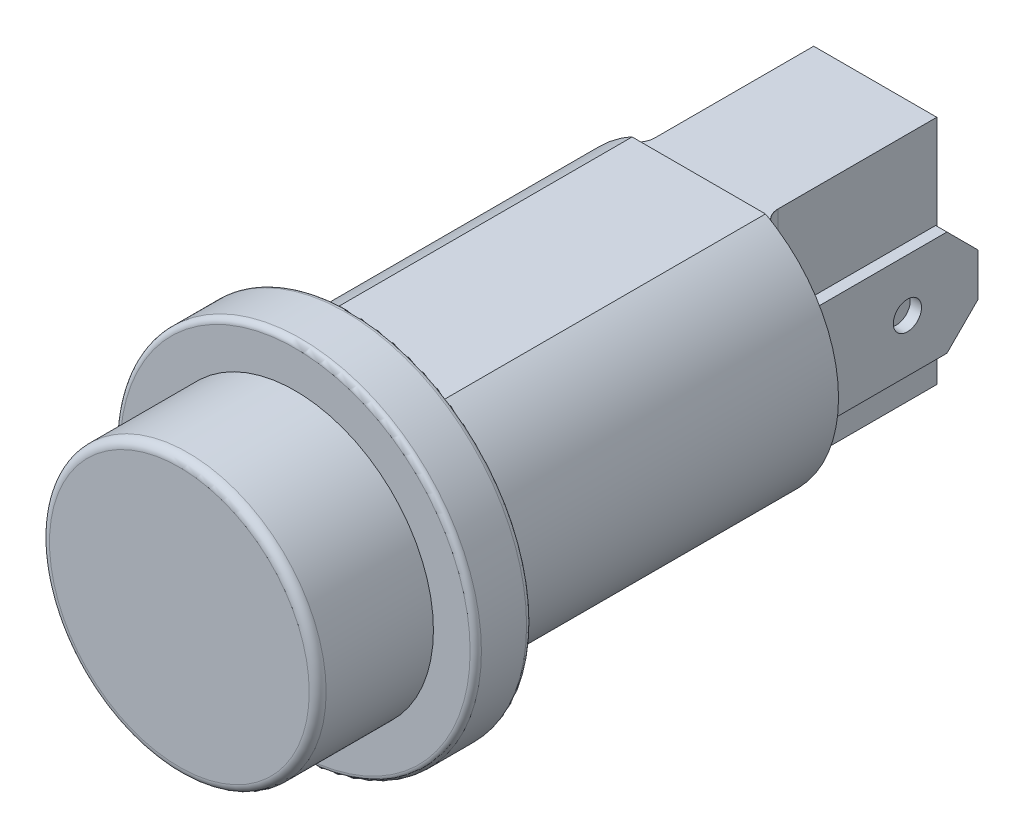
ISO-10303-21;
HEADER;
FILE_DESCRIPTION(('STEP AP214'),'2;1');
FILE_NAME('part.step','',(''),(''),'','','');
FILE_SCHEMA(('AUTOMOTIVE_DESIGN { 1 0 10303 214 1 1 1 1 }'));
ENDSEC;
DATA;
#1=APPLICATION_CONTEXT('core data for automotive mechanical design processes');
#2=APPLICATION_PROTOCOL_DEFINITION('international standard','automotive_design',2000,#1);
#3=PRODUCT_CONTEXT('',#1,'mechanical');
#4=PRODUCT('Part','Part','',(#3));
#5=PRODUCT_RELATED_PRODUCT_CATEGORY('part','',(#4));
#6=PRODUCT_DEFINITION_FORMATION('','',#4);
#7=PRODUCT_DEFINITION_CONTEXT('part definition',#1,'design');
#8=PRODUCT_DEFINITION('design','',#6,#7);
#9=PRODUCT_DEFINITION_SHAPE('','',#8);
#10=(LENGTH_UNIT() NAMED_UNIT(*) SI_UNIT(.MILLI.,.METRE.));
#11=(NAMED_UNIT(*) PLANE_ANGLE_UNIT() SI_UNIT($,.RADIAN.));
#12=(NAMED_UNIT(*) SI_UNIT($,.STERADIAN.) SOLID_ANGLE_UNIT());
#13=UNCERTAINTY_MEASURE_WITH_UNIT(LENGTH_MEASURE(1.E-05),#10,'distance_accuracy_value','');
#14=(GEOMETRIC_REPRESENTATION_CONTEXT(3) GLOBAL_UNCERTAINTY_ASSIGNED_CONTEXT((#13)) GLOBAL_UNIT_ASSIGNED_CONTEXT((#10,
#11,#12)) REPRESENTATION_CONTEXT('',''));
#15=CARTESIAN_POINT('',(0.,0.,0.));
#16=DIRECTION('',(0.,0.,1.));
#17=DIRECTION('',(1.,0.,0.));
#18=AXIS2_PLACEMENT_3D('',#15,#16,#17);
#19=CARTESIAN_POINT('',(-4.6228,2.3622,-19.6215));
#20=DIRECTION('',(1.,0.,0.));
#21=DIRECTION('',(0.,0.,-1.));
#22=AXIS2_PLACEMENT_3D('',#19,#20,#21);
#23=PLANE('',#22);
#24=DIRECTION('',(0.,1.,0.));
#25=VECTOR('',#24,1.);
#26=CARTESIAN_POINT('',(-4.6228,2.3622,-19.6215));
#27=LINE('',#26,#25);
#28=CARTESIAN_POINT('',(-4.6228,-0.965199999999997,-19.6215));
#29=VERTEX_POINT('',#28);
#30=CARTESIAN_POINT('',(-4.6228,0.965199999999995,-19.6215));
#31=VERTEX_POINT('',#30);
#32=EDGE_CURVE('E228',#29,#31,#27,.T.);
#33=ORIENTED_EDGE('',*,*,#32,.F.);
#34=DIRECTION('',(0.,0.707106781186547,-0.707106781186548));
#35=VECTOR('',#34,1.);
#36=CARTESIAN_POINT('',(-4.6228,-0.965199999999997,-19.6215));
#37=LINE('',#36,#35);
#38=CARTESIAN_POINT('',(-4.6228,-2.3622,-18.2245));
#39=VERTEX_POINT('',#38);
#40=EDGE_CURVE('E207',#29,#39,#37,.F.);
#41=ORIENTED_EDGE('',*,*,#40,.T.);
#42=DIRECTION('',(0.,0.,1.));
#43=VECTOR('',#42,1.);
#44=CARTESIAN_POINT('',(-4.6228,-2.3622,-19.6215));
#45=LINE('',#44,#43);
#46=CARTESIAN_POINT('',(-4.6228,-2.3622,-11.684));
#47=VERTEX_POINT('',#46);
#48=EDGE_CURVE('E201',#39,#47,#45,.T.);
#49=ORIENTED_EDGE('',*,*,#48,.T.);
#50=DIRECTION('',(0.,1.,0.));
#51=VECTOR('',#50,1.);
#52=CARTESIAN_POINT('',(-4.6228,2.3622,-11.684));
#53=LINE('',#52,#51);
#54=CARTESIAN_POINT('',(-4.6228,2.3622,-11.684));
#55=VERTEX_POINT('',#54);
#56=EDGE_CURVE('E206',#47,#55,#53,.T.);
#57=ORIENTED_EDGE('',*,*,#56,.T.);
#58=DIRECTION('',(0.,0.,1.));
#59=VECTOR('',#58,1.);
#60=CARTESIAN_POINT('',(-4.6228,2.3622,-19.6215));
#61=LINE('',#60,#59);
#62=CARTESIAN_POINT('',(-4.6228,2.3622,-18.2245));
#63=VERTEX_POINT('',#62);
#64=EDGE_CURVE('E239',#63,#55,#61,.T.);
#65=ORIENTED_EDGE('',*,*,#64,.F.);
#66=DIRECTION('',(0.,0.707106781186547,0.707106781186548));
#67=VECTOR('',#66,1.);
#68=CARTESIAN_POINT('',(-4.6228,0.965199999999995,-19.6215));
#69=LINE('',#68,#67);
#70=EDGE_CURVE('E1024',#63,#31,#69,.F.);
#71=ORIENTED_EDGE('',*,*,#70,.T.);
#72=EDGE_LOOP('',(#33,#41,#49,#57,#65,#71));
#73=FACE_BOUND('',#72,.T.);
#74=CARTESIAN_POINT('',(-4.6228,0.,-16.4465));
#75=DIRECTION('',(1.,0.,0.));
#76=DIRECTION('',(0.,0.,-1.));
#77=AXIS2_PLACEMENT_3D('',#74,#75,#76);
#78=CIRCLE('',#77,0.634999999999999);
#79=CARTESIAN_POINT('',(-4.6228,0.,-17.0815));
#80=VERTEX_POINT('',#79);
#81=EDGE_CURVE('E1039',#80,#80,#78,.T.);
#82=ORIENTED_EDGE('',*,*,#81,.T.);
#83=EDGE_LOOP('',(#82));
#84=FACE_BOUND('',#83,.T.);
#85=ADVANCED_FACE('F38',(#73,#84),#23,.F.);
#86=CARTESIAN_POINT('',(-4.1148,2.3622,-19.6215));
#87=DIRECTION('',(-1.,0.,0.));
#88=DIRECTION('',(0.,0.,1.));
#89=AXIS2_PLACEMENT_3D('',#86,#87,#88);
#90=PLANE('',#89);
#91=DIRECTION('',(0.,0.,1.));
#92=VECTOR('',#91,1.);
#93=CARTESIAN_POINT('',(-4.1148,-2.3622,-19.6215));
#94=LINE('',#93,#92);
#95=CARTESIAN_POINT('',(-4.1148,-2.3622,-18.2245));
#96=VERTEX_POINT('',#95);
#97=CARTESIAN_POINT('',(-4.1148,-2.3622,-11.684));
#98=VERTEX_POINT('',#97);
#99=EDGE_CURVE('E211',#96,#98,#94,.T.);
#100=ORIENTED_EDGE('',*,*,#99,.F.);
#101=DIRECTION('',(0.,-0.707106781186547,0.707106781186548));
#102=VECTOR('',#101,1.);
#103=CARTESIAN_POINT('',(-4.1148,-0.965199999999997,-19.6215));
#104=LINE('',#103,#102);
#105=CARTESIAN_POINT('',(-4.1148,-0.965199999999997,-19.6215));
#106=VERTEX_POINT('',#105);
#107=EDGE_CURVE('E1017',#96,#106,#104,.F.);
#108=ORIENTED_EDGE('',*,*,#107,.T.);
#109=DIRECTION('',(0.,-1.,0.));
#110=VECTOR('',#109,1.);
#111=CARTESIAN_POINT('',(-4.1148,2.3622,-19.6215));
#112=LINE('',#111,#110);
#113=CARTESIAN_POINT('',(-4.1148,0.965199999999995,-19.6215));
#114=VERTEX_POINT('',#113);
#115=EDGE_CURVE('E212',#114,#106,#112,.T.);
#116=ORIENTED_EDGE('',*,*,#115,.F.);
#117=DIRECTION('',(0.,-0.707106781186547,-0.707106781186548));
#118=VECTOR('',#117,1.);
#119=CARTESIAN_POINT('',(-4.1148,0.965199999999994,-19.6215));
#120=LINE('',#119,#118);
#121=CARTESIAN_POINT('',(-4.1148,2.3622,-18.2245));
#122=VERTEX_POINT('',#121);
#123=EDGE_CURVE('E1019',#114,#122,#120,.F.);
#124=ORIENTED_EDGE('',*,*,#123,.T.);
#125=DIRECTION('',(0.,0.,1.));
#126=VECTOR('',#125,1.);
#127=CARTESIAN_POINT('',(-4.1148,2.3622,-19.6215));
#128=LINE('',#127,#126);
#129=CARTESIAN_POINT('',(-4.1148,2.3622,-11.684));
#130=VERTEX_POINT('',#129);
#131=EDGE_CURVE('E237',#122,#130,#128,.T.);
#132=ORIENTED_EDGE('',*,*,#131,.T.);
#133=DIRECTION('',(0.,-1.,0.));
#134=VECTOR('',#133,1.);
#135=CARTESIAN_POINT('',(-4.1148,2.3622,-11.684));
#136=LINE('',#135,#134);
#137=EDGE_CURVE('E229',#130,#98,#136,.T.);
#138=ORIENTED_EDGE('',*,*,#137,.T.);
#139=EDGE_LOOP('',(#100,#108,#116,#124,#132,#138));
#140=FACE_BOUND('',#139,.T.);
#141=CARTESIAN_POINT('',(-4.1148,0.,-16.4465));
#142=DIRECTION('',(-1.,0.,0.));
#143=DIRECTION('',(0.,0.,1.));
#144=AXIS2_PLACEMENT_3D('',#141,#142,#143);
#145=CIRCLE('',#144,0.634999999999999);
#146=CARTESIAN_POINT('',(-4.1148,0.,-15.8115));
#147=VERTEX_POINT('',#146);
#148=EDGE_CURVE('E42',#147,#147,#145,.F.);
#149=ORIENTED_EDGE('',*,*,#148,.F.);
#150=EDGE_LOOP('',(#149));
#151=FACE_BOUND('',#150,.T.);
#152=ADVANCED_FACE('F453',(#140,#151),#90,.F.);
#153=CARTESIAN_POINT('',(0.,6.2865,-11.684));
#154=DIRECTION('',(0.,0.,1.));
#155=DIRECTION('',(1.,0.,0.));
#156=AXIS2_PLACEMENT_3D('',#153,#154,#155);
#157=PLANE('',#156);
#158=DIRECTION('',(1.,0.,0.));
#159=VECTOR('',#158,1.);
#160=CARTESIAN_POINT('',(2.7686,5.207,-11.684));
#161=LINE('',#160,#159);
#162=CARTESIAN_POINT('',(-3.52239027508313,5.20699999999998,-11.684));
#163=VERTEX_POINT('',#162);
#164=CARTESIAN_POINT('',(3.5223902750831,5.207,-11.684));
#165=VERTEX_POINT('',#164);
#166=EDGE_CURVE('E272',#163,#165,#161,.T.);
#167=ORIENTED_EDGE('',*,*,#166,.F.);
#168=CARTESIAN_POINT('',(0.,0.,-11.684));
#169=DIRECTION('',(0.,0.,1.));
#170=DIRECTION('',(1.,0.,0.));
#171=AXIS2_PLACEMENT_3D('',#168,#169,#170);
#172=CIRCLE('',#171,6.2865);
#173=CARTESIAN_POINT('',(-2.9999969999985,5.5245,-11.684));
#174=VERTEX_POINT('',#173);
#175=EDGE_CURVE('E314',#174,#163,#172,.T.);
#176=ORIENTED_EDGE('',*,*,#175,.F.);
#177=DIRECTION('',(1.,0.,0.));
#178=VECTOR('',#177,1.);
#179=CARTESIAN_POINT('',(0.,5.5245,-11.684));
#180=LINE('',#179,#178);
#181=CARTESIAN_POINT('',(2.9999969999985,5.5245,-11.684));
#182=VERTEX_POINT('',#181);
#183=EDGE_CURVE('E330',#174,#182,#180,.T.);
#184=ORIENTED_EDGE('',*,*,#183,.T.);
#185=EDGE_CURVE('E313',#165,#182,#172,.T.);
#186=ORIENTED_EDGE('',*,*,#185,.F.);
#187=EDGE_LOOP('',(#167,#176,#184,#186));
#188=FACE_BOUND('',#187,.T.);
#189=ADVANCED_FACE('F458',(#188),#157,.F.);
#190=ORIENTED_EDGE('',*,*,#56,.F.);
#191=DIRECTION('',(-1.,0.,0.));
#192=VECTOR('',#191,1.);
#193=CARTESIAN_POINT('',(-4.6228,-2.3622,-11.684));
#194=LINE('',#193,#192);
#195=EDGE_CURVE('E220',#98,#47,#194,.T.);
#196=ORIENTED_EDGE('',*,*,#195,.F.);
#197=ORIENTED_EDGE('',*,*,#137,.F.);
#198=DIRECTION('',(1.,0.,0.));
#199=VECTOR('',#198,1.);
#200=CARTESIAN_POINT('',(-4.6228,2.3622,-11.684));
#201=LINE('',#200,#199);
#202=EDGE_CURVE('E223',#55,#130,#201,.T.);
#203=ORIENTED_EDGE('',*,*,#202,.F.);
#204=EDGE_LOOP('',(#190,#196,#197,#203));
#205=FACE_BOUND('',#204,.T.);
#206=CARTESIAN_POINT('',(-3.56235,5.1797436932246,-11.684));
#207=VERTEX_POINT('',#206);
#208=CARTESIAN_POINT('',(-3.56235,-5.1797436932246,-11.684));
#209=VERTEX_POINT('',#208);
#210=EDGE_CURVE('E961',#207,#209,#172,.T.);
#211=ORIENTED_EDGE('',*,*,#210,.F.);
#212=DIRECTION('',(0.,1.,0.));
#213=VECTOR('',#212,1.);
#214=CARTESIAN_POINT('',(-3.56235,-5.207,-11.684));
#215=LINE('',#214,#213);
#216=EDGE_CURVE('E942',#207,#209,#215,.F.);
#217=ORIENTED_EDGE('',*,*,#216,.T.);
#218=EDGE_LOOP('',(#211,#217));
#219=FACE_BOUND('',#218,.T.);
#220=ADVANCED_FACE('F217',(#205,#219),#157,.F.);
#221=CARTESIAN_POINT('',(-3.5223902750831,-5.207,-11.684));
#222=VERTEX_POINT('',#221);
#223=CARTESIAN_POINT('',(3.52239027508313,-5.20699999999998,-11.684));
#224=VERTEX_POINT('',#223);
#225=EDGE_CURVE('E968',#222,#224,#172,.T.);
#226=ORIENTED_EDGE('',*,*,#225,.F.);
#227=DIRECTION('',(-1.,0.,0.));
#228=VECTOR('',#227,1.);
#229=CARTESIAN_POINT('',(2.7686,-5.207,-11.684));
#230=LINE('',#229,#228);
#231=EDGE_CURVE('E267',#224,#222,#230,.T.);
#232=ORIENTED_EDGE('',*,*,#231,.F.);
#233=EDGE_LOOP('',(#226,#232));
#234=FACE_BOUND('',#233,.T.);
#235=ADVANCED_FACE('F558',(#234),#157,.F.);
#236=DIRECTION('',(0.,-1.,0.));
#237=VECTOR('',#236,1.);
#238=CARTESIAN_POINT('',(4.6228,2.3622,-11.684));
#239=LINE('',#238,#237);
#240=CARTESIAN_POINT('',(4.6228,2.3622,-11.684));
#241=VERTEX_POINT('',#240);
#242=CARTESIAN_POINT('',(4.6228,-2.3622,-11.684));
#243=VERTEX_POINT('',#242);
#244=EDGE_CURVE('E241',#241,#243,#239,.T.);
#245=ORIENTED_EDGE('',*,*,#244,.F.);
#246=DIRECTION('',(1.,0.,0.));
#247=VECTOR('',#246,1.);
#248=CARTESIAN_POINT('',(4.6228,2.3622,-11.684));
#249=LINE('',#248,#247);
#250=CARTESIAN_POINT('',(4.1148,2.3622,-11.684));
#251=VERTEX_POINT('',#250);
#252=EDGE_CURVE('E246',#251,#241,#249,.T.);
#253=ORIENTED_EDGE('',*,*,#252,.F.);
#254=DIRECTION('',(0.,1.,0.));
#255=VECTOR('',#254,1.);
#256=CARTESIAN_POINT('',(4.1148,2.3622,-11.684));
#257=LINE('',#256,#255);
#258=CARTESIAN_POINT('',(4.1148,-2.3622,-11.684));
#259=VERTEX_POINT('',#258);
#260=EDGE_CURVE('E255',#259,#251,#257,.T.);
#261=ORIENTED_EDGE('',*,*,#260,.F.);
#262=DIRECTION('',(-1.,0.,0.));
#263=VECTOR('',#262,1.);
#264=CARTESIAN_POINT('',(4.6228,-2.3622,-11.684));
#265=LINE('',#264,#263);
#266=EDGE_CURVE('E252',#243,#259,#265,.T.);
#267=ORIENTED_EDGE('',*,*,#266,.F.);
#268=EDGE_LOOP('',(#245,#253,#261,#267));
#269=FACE_BOUND('',#268,.T.);
#270=CARTESIAN_POINT('',(3.56235,-5.1797436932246,-11.684));
#271=VERTEX_POINT('',#270);
#272=CARTESIAN_POINT('',(3.56235,5.1797436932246,-11.684));
#273=VERTEX_POINT('',#272);
#274=EDGE_CURVE('E973',#271,#273,#172,.T.);
#275=ORIENTED_EDGE('',*,*,#274,.F.);
#276=DIRECTION('',(0.,-1.,0.));
#277=VECTOR('',#276,1.);
#278=CARTESIAN_POINT('',(3.56235,5.207,-11.684));
#279=LINE('',#278,#277);
#280=EDGE_CURVE('E944',#271,#273,#279,.F.);
#281=ORIENTED_EDGE('',*,*,#280,.T.);
#282=EDGE_LOOP('',(#275,#281));
#283=FACE_BOUND('',#282,.T.);
#284=ADVANCED_FACE('F522',(#269,#283),#157,.F.);
#285=CARTESIAN_POINT('',(0.,0.,6.223));
#286=DIRECTION('',(0.,0.,1.));
#287=DIRECTION('',(1.,0.,0.));
#288=AXIS2_PLACEMENT_3D('',#285,#286,#287);
#289=TOROIDAL_SURFACE('',#288,7.874,0.254);
#290=CARTESIAN_POINT('',(0.,0.,6.477));
#291=DIRECTION('',(0.,0.,1.));
#292=DIRECTION('',(1.,0.,0.));
#293=AXIS2_PLACEMENT_3D('',#290,#291,#292);
#294=CIRCLE('',#293,7.874);
#295=CARTESIAN_POINT('',(7.874,0.,6.477));
#296=VERTEX_POINT('',#295);
#297=EDGE_CURVE('E301',#296,#296,#294,.T.);
#298=ORIENTED_EDGE('',*,*,#297,.F.);
#299=EDGE_LOOP('',(#298));
#300=FACE_BOUND('',#299,.T.);
#301=CARTESIAN_POINT('',(0.,0.,6.223));
#302=DIRECTION('',(0.,0.,1.));
#303=DIRECTION('',(1.,0.,0.));
#304=AXIS2_PLACEMENT_3D('',#301,#302,#303);
#305=CIRCLE('',#304,8.128);
#306=CARTESIAN_POINT('',(8.128,0.,6.223));
#307=VERTEX_POINT('',#306);
#308=EDGE_CURVE('E327',#307,#307,#305,.T.);
#309=ORIENTED_EDGE('',*,*,#308,.T.);
#310=EDGE_LOOP('',(#309));
#311=FACE_BOUND('',#310,.T.);
#312=ADVANCED_FACE('F350',(#300,#311),#289,.T.);
#313=CARTESIAN_POINT('',(0.,0.,11.684));
#314=DIRECTION('',(0.,0.,1.));
#315=DIRECTION('',(1.,0.,0.));
#316=AXIS2_PLACEMENT_3D('',#313,#314,#315);
#317=CYLINDRICAL_SURFACE('',#316,8.128);
#318=ORIENTED_EDGE('',*,*,#308,.F.);
#319=EDGE_LOOP('',(#318));
#320=FACE_BOUND('',#319,.T.);
#321=CARTESIAN_POINT('',(0.,0.,4.191));
#322=DIRECTION('',(0.,0.,1.));
#323=DIRECTION('',(1.,0.,0.));
#324=AXIS2_PLACEMENT_3D('',#321,#322,#323);
#325=CIRCLE('',#324,8.128);
#326=CARTESIAN_POINT('',(8.128,0.,4.191));
#327=VERTEX_POINT('',#326);
#328=EDGE_CURVE('E324',#327,#327,#325,.T.);
#329=ORIENTED_EDGE('',*,*,#328,.T.);
#330=EDGE_LOOP('',(#329));
#331=FACE_BOUND('',#330,.T.);
#332=ADVANCED_FACE('F540',(#320,#331),#317,.T.);
#333=CARTESIAN_POINT('',(0.,0.,4.191));
#334=DIRECTION('',(0.,0.,1.));
#335=DIRECTION('',(1.,0.,0.));
#336=AXIS2_PLACEMENT_3D('',#333,#334,#335);
#337=TOROIDAL_SURFACE('',#336,7.874,0.253999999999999);
#338=ORIENTED_EDGE('',*,*,#328,.F.);
#339=EDGE_LOOP('',(#338));
#340=FACE_BOUND('',#339,.T.);
#341=CARTESIAN_POINT('',(0.,0.,3.937));
#342=DIRECTION('',(0.,0.,1.));
#343=DIRECTION('',(1.,0.,0.));
#344=AXIS2_PLACEMENT_3D('',#341,#342,#343);
#345=CIRCLE('',#344,7.874);
#346=CARTESIAN_POINT('',(7.874,0.,3.937));
#347=VERTEX_POINT('',#346);
#348=EDGE_CURVE('E321',#347,#347,#345,.T.);
#349=ORIENTED_EDGE('',*,*,#348,.T.);
#350=EDGE_LOOP('',(#349));
#351=FACE_BOUND('',#350,.T.);
#352=ADVANCED_FACE('F537',(#340,#351),#337,.T.);
#353=CARTESIAN_POINT('',(0.,7.874,3.937));
#354=DIRECTION('',(0.,0.,1.));
#355=DIRECTION('',(1.,0.,0.));
#356=AXIS2_PLACEMENT_3D('',#353,#354,#355);
#357=PLANE('',#356);
#358=DIRECTION('',(-1.,0.,0.));
#359=VECTOR('',#358,1.);
#360=CARTESIAN_POINT('',(4.06350387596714,5.5245,3.937));
#361=LINE('',#360,#359);
#362=CARTESIAN_POINT('',(2.9999969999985,5.5245,3.937));
#363=VERTEX_POINT('',#362);
#364=CARTESIAN_POINT('',(-2.9999969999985,5.5245,3.937));
#365=VERTEX_POINT('',#364);
#366=EDGE_CURVE('E292',#363,#365,#361,.T.);
#367=ORIENTED_EDGE('',*,*,#366,.T.);
#368=CARTESIAN_POINT('',(0.,0.,3.937));
#369=DIRECTION('',(0.,0.,1.));
#370=DIRECTION('',(1.,0.,0.));
#371=AXIS2_PLACEMENT_3D('',#368,#369,#370);
#372=CIRCLE('',#371,6.2865);
#373=EDGE_CURVE('E317',#365,#363,#372,.T.);
#374=ORIENTED_EDGE('',*,*,#373,.T.);
#375=EDGE_LOOP('',(#367,#374));
#376=FACE_BOUND('',#375,.T.);
#377=ORIENTED_EDGE('',*,*,#348,.F.);
#378=EDGE_LOOP('',(#377));
#379=FACE_BOUND('',#378,.T.);
#380=ADVANCED_FACE('F530',(#376,#379),#357,.F.);
#381=CARTESIAN_POINT('',(0.,0.,11.684));
#382=DIRECTION('',(0.,0.,1.));
#383=DIRECTION('',(1.,0.,0.));
#384=AXIS2_PLACEMENT_3D('',#381,#382,#383);
#385=CYLINDRICAL_SURFACE('',#384,6.2865);
#386=ORIENTED_EDGE('',*,*,#175,.T.);
#387=EDGE_CURVE('E318',#163,#207,#172,.T.);
#388=ORIENTED_EDGE('',*,*,#387,.T.);
#389=ORIENTED_EDGE('',*,*,#210,.T.);
#390=EDGE_CURVE('E966',#209,#222,#172,.T.);
#391=ORIENTED_EDGE('',*,*,#390,.T.);
#392=ORIENTED_EDGE('',*,*,#225,.T.);
#393=EDGE_CURVE('E969',#224,#271,#172,.T.);
#394=ORIENTED_EDGE('',*,*,#393,.T.);
#395=ORIENTED_EDGE('',*,*,#274,.T.);
#396=EDGE_CURVE('E976',#273,#165,#172,.T.);
#397=ORIENTED_EDGE('',*,*,#396,.T.);
#398=ORIENTED_EDGE('',*,*,#185,.T.);
#399=DIRECTION('',(0.,0.,1.));
#400=VECTOR('',#399,1.);
#401=CARTESIAN_POINT('',(2.9999969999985,5.5245,11.684));
#402=LINE('',#401,#400);
#403=EDGE_CURVE('E298',#182,#363,#402,.T.);
#404=ORIENTED_EDGE('',*,*,#403,.T.);
#405=ORIENTED_EDGE('',*,*,#373,.F.);
#406=DIRECTION('',(0.,0.,1.));
#407=VECTOR('',#406,1.);
#408=CARTESIAN_POINT('',(-2.9999969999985,5.5245,11.684));
#409=LINE('',#408,#407);
#410=EDGE_CURVE('E295',#365,#174,#409,.F.);
#411=ORIENTED_EDGE('',*,*,#410,.T.);
#412=EDGE_LOOP('',(#386,#388,#389,#391,#392,#394,#395,#397,#398,#404,#405,#411));
#413=FACE_BOUND('',#412,.T.);
#414=ADVANCED_FACE('F525',(#413),#385,.T.);
#415=CARTESIAN_POINT('',(0.,5.842,11.684));
#416=DIRECTION('',(0.,0.,-1.));
#417=DIRECTION('',(-1.,0.,0.));
#418=AXIS2_PLACEMENT_3D('',#415,#416,#417);
#419=PLANE('',#418);
#420=CARTESIAN_POINT('',(0.,0.,11.684));
#421=DIRECTION('',(0.,0.,1.));
#422=DIRECTION('',(1.,0.,0.));
#423=AXIS2_PLACEMENT_3D('',#420,#421,#422);
#424=CIRCLE('',#423,5.842);
#425=CARTESIAN_POINT('',(5.842,0.,11.684));
#426=VERTEX_POINT('',#425);
#427=EDGE_CURVE('E310',#426,#426,#424,.T.);
#428=ORIENTED_EDGE('',*,*,#427,.T.);
#429=EDGE_LOOP('',(#428));
#430=FACE_BOUND('',#429,.T.);
#431=ADVANCED_FACE('F529',(#430),#419,.F.);
#432=CARTESIAN_POINT('',(0.,0.,11.303));
#433=DIRECTION('',(0.,0.,1.));
#434=DIRECTION('',(1.,0.,0.));
#435=AXIS2_PLACEMENT_3D('',#432,#433,#434);
#436=TOROIDAL_SURFACE('',#435,5.842,0.380999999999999);
#437=ORIENTED_EDGE('',*,*,#427,.F.);
#438=EDGE_LOOP('',(#437));
#439=FACE_BOUND('',#438,.T.);
#440=CARTESIAN_POINT('',(0.,0.,11.303));
#441=DIRECTION('',(0.,0.,1.));
#442=DIRECTION('',(1.,0.,0.));
#443=AXIS2_PLACEMENT_3D('',#440,#441,#442);
#444=CIRCLE('',#443,6.223);
#445=CARTESIAN_POINT('',(6.223,0.,11.303));
#446=VERTEX_POINT('',#445);
#447=EDGE_CURVE('E307',#446,#446,#444,.T.);
#448=ORIENTED_EDGE('',*,*,#447,.T.);
#449=EDGE_LOOP('',(#448));
#450=FACE_BOUND('',#449,.T.);
#451=ADVANCED_FACE('F573',(#439,#450),#436,.T.);
#452=CARTESIAN_POINT('',(0.,0.,11.684));
#453=DIRECTION('',(0.,0.,1.));
#454=DIRECTION('',(1.,0.,0.));
#455=AXIS2_PLACEMENT_3D('',#452,#453,#454);
#456=CYLINDRICAL_SURFACE('',#455,6.223);
#457=ORIENTED_EDGE('',*,*,#447,.F.);
#458=EDGE_LOOP('',(#457));
#459=FACE_BOUND('',#458,.T.);
#460=CARTESIAN_POINT('',(0.,0.,6.477));
#461=DIRECTION('',(0.,0.,1.));
#462=DIRECTION('',(1.,0.,0.));
#463=AXIS2_PLACEMENT_3D('',#460,#461,#462);
#464=CIRCLE('',#463,6.223);
#465=CARTESIAN_POINT('',(6.223,0.,6.477));
#466=VERTEX_POINT('',#465);
#467=EDGE_CURVE('E304',#466,#466,#464,.T.);
#468=ORIENTED_EDGE('',*,*,#467,.T.);
#469=EDGE_LOOP('',(#468));
#470=FACE_BOUND('',#469,.T.);
#471=ADVANCED_FACE('F565',(#459,#470),#456,.T.);
#472=CARTESIAN_POINT('',(0.,6.223,6.477));
#473=DIRECTION('',(0.,0.,-1.));
#474=DIRECTION('',(-1.,0.,0.));
#475=AXIS2_PLACEMENT_3D('',#472,#473,#474);
#476=PLANE('',#475);
#477=ORIENTED_EDGE('',*,*,#467,.F.);
#478=EDGE_LOOP('',(#477));
#479=FACE_BOUND('',#478,.T.);
#480=ORIENTED_EDGE('',*,*,#297,.T.);
#481=EDGE_LOOP('',(#480));
#482=FACE_BOUND('',#481,.T.);
#483=ADVANCED_FACE('F562',(#479,#482),#476,.F.);
#484=CARTESIAN_POINT('',(4.06350387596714,5.5245,12.1726831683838));
#485=DIRECTION('',(0.,-1.,0.));
#486=DIRECTION('',(0.,0.,-1.));
#487=AXIS2_PLACEMENT_3D('',#484,#485,#486);
#488=PLANE('',#487);
#489=ORIENTED_EDGE('',*,*,#183,.F.);
#490=ORIENTED_EDGE('',*,*,#410,.F.);
#491=ORIENTED_EDGE('',*,*,#366,.F.);
#492=ORIENTED_EDGE('',*,*,#403,.F.);
#493=EDGE_LOOP('',(#489,#490,#491,#492));
#494=FACE_BOUND('',#493,.T.);
#495=ADVANCED_FACE('F564',(#494),#488,.F.);
#496=CARTESIAN_POINT('',(2.7686,5.207,-19.6215));
#497=DIRECTION('',(-1.,0.,0.));
#498=DIRECTION('',(0.,0.,1.));
#499=AXIS2_PLACEMENT_3D('',#496,#497,#498);
#500=PLANE('',#499);
#501=DIRECTION('',(0.,0.,1.));
#502=VECTOR('',#501,1.);
#503=CARTESIAN_POINT('',(2.7686,5.207,-19.6215));
#504=LINE('',#503,#502);
#505=CARTESIAN_POINT('',(2.7686,5.207,-19.6215));
#506=VERTEX_POINT('',#505);
#507=CARTESIAN_POINT('',(2.7686,5.207,-12.4774316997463));
#508=VERTEX_POINT('',#507);
#509=EDGE_CURVE('E278',#506,#508,#504,.T.);
#510=ORIENTED_EDGE('',*,*,#509,.T.);
#511=CARTESIAN_POINT('',(2.7686,5.52477192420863,-12.4239723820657));
#512=CARTESIAN_POINT('',(2.7686,5.32297180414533,-11.8053040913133));
#513=CARTESIAN_POINT('',(3.40671712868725,5.28340426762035,-11.684));
#514=CARTESIAN_POINT('',(2.7686,5.47240951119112,-12.4410446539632));
#515=CARTESIAN_POINT('',(2.7686,5.29691152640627,-11.7931497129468));
#516=CARTESIAN_POINT('',(3.42951286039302,5.26870944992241,-11.684));
#517=CARTESIAN_POINT('',(2.7686,5.41878530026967,-12.4539599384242));
#518=CARTESIAN_POINT('',(2.7686,5.2720391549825,-11.7775484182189));
#519=CARTESIAN_POINT('',(3.45324178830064,5.25319631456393,-11.684));
#520=CARTESIAN_POINT('',(2.7686,5.31134394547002,-12.4715526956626));
#521=CARTESIAN_POINT('',(2.7686,5.22635204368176,-11.7404979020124));
#522=CARTESIAN_POINT('',(3.50158303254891,5.22109322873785,-11.684));
#523=CARTESIAN_POINT('',(2.7686,5.25755427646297,-12.4763967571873));
#524=CARTESIAN_POINT('',(2.7686,5.20548503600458,-11.7189475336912));
#525=CARTESIAN_POINT('',(3.52616650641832,5.2045325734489,-11.684));
#526=CARTESIAN_POINT('',(2.7686,5.14231125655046,-12.4787665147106));
#527=CARTESIAN_POINT('',(2.7686,5.16657938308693,-11.6667784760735));
#528=CARTESIAN_POINT('',(3.57971761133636,5.16787099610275,-11.684));
#529=CARTESIAN_POINT('',(2.7686,5.08083539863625,-12.4751772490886));
#530=CARTESIAN_POINT('',(2.7686,5.14961486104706,-11.6351031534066));
#531=CARTESIAN_POINT('',(3.60881849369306,5.14759845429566,-11.684));
#532=CARTESIAN_POINT('',(2.7686,4.95768468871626,-12.4583664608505));
#533=CARTESIAN_POINT('',(2.7686,5.12574519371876,-11.5653410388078));
#534=CARTESIAN_POINT('',(3.66816750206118,5.10548918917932,-11.684));
#535=CARTESIAN_POINT('',(2.7686,4.89604143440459,-12.4449125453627));
#536=CARTESIAN_POINT('',(2.7686,5.11953605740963,-11.5267830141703));
#537=CARTESIAN_POINT('',(3.69842630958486,5.08362639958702,-11.684));
#538=CARTESIAN_POINT('',(2.7686,4.83586518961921,-12.4266577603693));
#539=CARTESIAN_POINT('',(2.7686,5.12117213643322,-11.4873564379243));
#540=CARTESIAN_POINT('',(3.72852226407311,5.06144287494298,-11.684));
#541=(BOUNDED_SURFACE() B_SPLINE_SURFACE(3,2,((#511,#512,#513),(#514,#515,#516),(#517,#518,
#519),(#520,#521,#522),(#523,#524,#525),(#526,#527,#528),(#529,#530,#531),(#532,#533,#534),
(#535,#536,#537),(#538,#539,#540)),.UNSPECIFIED.,.F.,.F.,.F.) B_SPLINE_SURFACE_WITH_KNOTS((4,2,
2,2,4),(3,3),(0.,0.164922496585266,0.326396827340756,0.510392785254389,0.698868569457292),(0.,
1.),.UNSPECIFIED.) GEOMETRIC_REPRESENTATION_ITEM() RATIONAL_B_SPLINE_SURFACE(((1.,
0.773328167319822,1.),(1.,0.764043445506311,1.),(1.,0.754212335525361,1.),(1.,0.733744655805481,
1.),(1.,0.723129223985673,1.),(1.,0.699441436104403,1.),(1.,0.686232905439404,1.),(1.,
0.658439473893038,1.),(1.,0.643828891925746,1.),(1.,0.628748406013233,1.))) REPRESENTATION_ITEM('') SURFACE());
#542=CARTESIAN_POINT('',(2.7686,5.52477192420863,-12.4239723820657));
#543=CARTESIAN_POINT('',(2.7686,5.47240951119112,-12.4410446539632));
#544=CARTESIAN_POINT('',(2.7686,5.41878530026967,-12.4539599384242));
#545=CARTESIAN_POINT('',(2.7686,5.31134394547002,-12.4715526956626));
#546=CARTESIAN_POINT('',(2.7686,5.25755427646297,-12.4763967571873));
#547=CARTESIAN_POINT('',(2.7686,5.14231125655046,-12.4787665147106));
#548=CARTESIAN_POINT('',(2.7686,5.08083539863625,-12.4751772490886));
#549=CARTESIAN_POINT('',(2.7686,4.95768468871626,-12.4583664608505));
#550=CARTESIAN_POINT('',(2.7686,4.89604143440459,-12.4449125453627));
#551=CARTESIAN_POINT('',(2.7686,4.83586518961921,-12.4266577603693));
#552=B_SPLINE_CURVE_WITH_KNOTS('',3,(#542,#543,#544,#545,#546,#547,#548,#549,#550,#551),
.UNSPECIFIED.,.F.,.F.,(4,2,2,2,4),(0.,0.164922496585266,0.326396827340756,0.510392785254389,
0.698868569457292),.UNSPECIFIED.);
#553=CARTESIAN_POINT('',(2.7686,5.1797436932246,-12.47775));
#554=VERTEX_POINT('',#553);
#555=EDGE_CURVE('E920',#508,#554,#552,.T.);
#556=ORIENTED_EDGE('',*,*,#555,.T.);
#557=DIRECTION('',(0.,-1.,0.));
#558=VECTOR('',#557,1.);
#559=CARTESIAN_POINT('',(2.7686,-5.207,-12.47775));
#560=LINE('',#559,#558);
#561=CARTESIAN_POINT('',(2.7686,-5.1797436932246,-12.47775));
#562=VERTEX_POINT('',#561);
#563=EDGE_CURVE('E927',#554,#562,#560,.T.);
#564=ORIENTED_EDGE('',*,*,#563,.T.);
#565=CARTESIAN_POINT('',(2.7686,-4.83266114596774,-12.4256795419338));
#566=CARTESIAN_POINT('',(2.7686,-5.12126419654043,-11.4852149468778));
#567=CARTESIAN_POINT('',(3.73012413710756,-5.06026246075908,-11.684));
#568=CARTESIAN_POINT('',(2.7686,-4.89293530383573,-12.4441447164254));
#569=CARTESIAN_POINT('',(2.7686,-5.11935456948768,-11.5247810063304));
#570=CARTESIAN_POINT('',(3.69996230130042,-5.08250849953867,-11.684));
#571=CARTESIAN_POINT('',(2.7686,-4.95467036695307,-12.4577923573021));
#572=CARTESIAN_POINT('',(2.7686,-5.12534518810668,-11.5635100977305));
#573=CARTESIAN_POINT('',(3.66963899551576,-5.10443198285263,-11.684));
#574=CARTESIAN_POINT('',(2.7686,-5.07785894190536,-12.4749225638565));
#575=CARTESIAN_POINT('',(2.7686,-5.14887494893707,-11.6335219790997));
#576=CARTESIAN_POINT('',(3.61023584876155,-5.14660473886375,-11.684));
#577=CARTESIAN_POINT('',(2.7686,-5.13927640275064,-12.4786654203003));
#578=CARTESIAN_POINT('',(2.7686,-5.16567763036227,-11.6652883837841));
#579=CARTESIAN_POINT('',(3.58114436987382,-5.16688300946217,-11.684));
#580=CARTESIAN_POINT('',(2.7686,-5.26629232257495,-12.4763835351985));
#581=CARTESIAN_POINT('',(2.7686,-5.2081742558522,-11.7228302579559));
#582=CARTESIAN_POINT('',(3.52208926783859,-5.20733537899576,-11.684));
#583=CARTESIAN_POINT('',(2.7686,-5.33188191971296,-12.4696553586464));
#584=CARTESIAN_POINT('',(2.7686,-5.23423923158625,-11.7485297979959));
#585=CARTESIAN_POINT('',(3.49220756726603,-5.22740243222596,-11.684));
#586=CARTESIAN_POINT('',(2.7686,-5.46268445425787,-12.4442938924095));
#587=CARTESIAN_POINT('',(2.7686,-5.29174482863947,-11.7908051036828));
#588=CARTESIAN_POINT('',(3.43372503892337,-5.26601402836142,-11.684));
#589=CARTESIAN_POINT('',(2.7686,-5.52783040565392,-12.4253185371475));
#590=CARTESIAN_POINT('',(2.7686,-5.32331086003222,-11.8075246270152));
#591=CARTESIAN_POINT('',(3.40518713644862,-5.28449696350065,-11.684));
#592=CARTESIAN_POINT('',(2.7686,-5.59062377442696,-12.3999897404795));
#593=CARTESIAN_POINT('',(2.7686,-5.35607435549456,-11.8188136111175));
#594=CARTESIAN_POINT('',(3.37822629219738,-5.30166665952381,-11.684));
#595=(BOUNDED_SURFACE() B_SPLINE_SURFACE(3,2,((#565,#566,#567),(#568,#569,#570),(#571,#572,
#573),(#574,#575,#576),(#577,#578,#579),(#580,#581,#582),(#583,#584,#585),(#586,#587,#588),
(#589,#590,#591),(#592,#593,#594)),.UNSPECIFIED.,.F.,.F.,.F.) B_SPLINE_SURFACE_WITH_KNOTS((4,2,
2,2,4),(3,3),(0.,0.188889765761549,0.372763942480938,0.569533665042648,0.772052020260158),(0.,
1.),.UNSPECIFIED.) GEOMETRIC_REPRESENTATION_ITEM() RATIONAL_B_SPLINE_SURFACE(((1.,
0.627945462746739,1.),(1.,0.64307792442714,1.),(1.,0.657736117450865,1.),(1.,0.685582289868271,
1.),(1.,0.698798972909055,1.),(1.,0.724944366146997,1.),(1.,0.737787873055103,1.),(1.,
0.762350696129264,1.),(1.,0.77402620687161,1.),(1.,0.784846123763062,1.))) REPRESENTATION_ITEM('') SURFACE());
#596=CARTESIAN_POINT('',(2.7686,-4.83266114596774,-12.4256795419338));
#597=CARTESIAN_POINT('',(2.7686,-4.89293530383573,-12.4441447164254));
#598=CARTESIAN_POINT('',(2.7686,-4.95467036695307,-12.4577923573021));
#599=CARTESIAN_POINT('',(2.7686,-5.07785894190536,-12.4749225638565));
#600=CARTESIAN_POINT('',(2.7686,-5.13927640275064,-12.4786654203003));
#601=CARTESIAN_POINT('',(2.7686,-5.26629232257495,-12.4763835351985));
#602=CARTESIAN_POINT('',(2.7686,-5.33188191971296,-12.4696553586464));
#603=CARTESIAN_POINT('',(2.7686,-5.46268445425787,-12.4442938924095));
#604=CARTESIAN_POINT('',(2.7686,-5.52783040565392,-12.4253185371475));
#605=CARTESIAN_POINT('',(2.7686,-5.59062377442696,-12.3999897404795));
#606=B_SPLINE_CURVE_WITH_KNOTS('',3,(#596,#597,#598,#599,#600,#601,#602,#603,#604,#605),
.UNSPECIFIED.,.F.,.F.,(4,2,2,2,4),(0.,0.188889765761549,0.372763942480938,0.569533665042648,
0.772052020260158),.UNSPECIFIED.);
#607=CARTESIAN_POINT('',(2.7686,-5.207,-12.4774316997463));
#608=VERTEX_POINT('',#607);
#609=EDGE_CURVE('E930',#562,#608,#606,.T.);
#610=ORIENTED_EDGE('',*,*,#609,.T.);
#611=DIRECTION('',(0.,0.,1.));
#612=VECTOR('',#611,1.);
#613=CARTESIAN_POINT('',(2.7686,-5.207,-19.6215));
#614=LINE('',#613,#612);
#615=CARTESIAN_POINT('',(2.7686,-5.207,-19.6215));
#616=VERTEX_POINT('',#615);
#617=EDGE_CURVE('E289',#616,#608,#614,.T.);
#618=ORIENTED_EDGE('',*,*,#617,.F.);
#619=DIRECTION('',(0.,-1.,0.));
#620=VECTOR('',#619,1.);
#621=CARTESIAN_POINT('',(2.7686,5.207,-19.6215));
#622=LINE('',#621,#620);
#623=EDGE_CURVE('E268',#506,#616,#622,.T.);
#624=ORIENTED_EDGE('',*,*,#623,.F.);
#625=EDGE_LOOP('',(#510,#556,#564,#610,#618,#624));
#626=FACE_BOUND('',#625,.T.);
#627=ADVANCED_FACE('F397',(#626),#500,.F.);
#628=CARTESIAN_POINT('',(2.7686,-5.207,-19.6215));
#629=DIRECTION('',(0.,1.,0.));
#630=DIRECTION('',(-1.,0.,0.));
#631=AXIS2_PLACEMENT_3D('',#628,#629,#630);
#632=PLANE('',#631);
#633=ORIENTED_EDGE('',*,*,#231,.T.);
#634=CARTESIAN_POINT('',(-2.7686,-5.52477192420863,-12.4239723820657));
#635=CARTESIAN_POINT('',(-2.7686,-5.32297179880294,-11.8053040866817));
#636=CARTESIAN_POINT('',(-3.40671713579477,-5.28340426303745,-11.684));
#637=CARTESIAN_POINT('',(-2.7686,-5.47240951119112,-12.4410446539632));
#638=CARTESIAN_POINT('',(-2.7686,-5.29691152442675,-11.7931497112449));
#639=CARTESIAN_POINT('',(-3.42951286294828,-5.26870944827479,-11.684));
#640=CARTESIAN_POINT('',(-2.7686,-5.41878530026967,-12.4539599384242));
#641=CARTESIAN_POINT('',(-2.7686,-5.27203915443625,-11.7775484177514));
#642=CARTESIAN_POINT('',(-3.45324178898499,-5.25319631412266,-11.684));
#643=CARTESIAN_POINT('',(-2.7686,-5.31134394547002,-12.4715526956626));
#644=CARTESIAN_POINT('',(-2.7686,-5.22635204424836,-11.7404979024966));
#645=CARTESIAN_POINT('',(-3.50158303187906,-5.22109322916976,-11.684));
#646=CARTESIAN_POINT('',(-2.7686,-5.25755427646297,-12.4763967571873));
#647=CARTESIAN_POINT('',(-2.7686,-5.20548503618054,-11.718947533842));
#648=CARTESIAN_POINT('',(-3.52616650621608,-5.20453257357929,-11.684));
#649=CARTESIAN_POINT('',(-2.7686,-5.14231125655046,-12.4787665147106));
#650=CARTESIAN_POINT('',(-2.7686,-5.16657938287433,-11.6667784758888));
#651=CARTESIAN_POINT('',(-3.5797176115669,-5.1678709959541,-11.684));
#652=CARTESIAN_POINT('',(-2.7686,-5.08083539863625,-12.4751772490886));
#653=CARTESIAN_POINT('',(-2.7686,-5.14961486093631,-11.6351031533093));
#654=CARTESIAN_POINT('',(-3.60881849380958,-5.14759845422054,-11.684));
#655=CARTESIAN_POINT('',(-2.7686,-4.95768468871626,-12.4583664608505));
#656=CARTESIAN_POINT('',(-2.7686,-5.12574519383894,-11.5653410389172));
#657=CARTESIAN_POINT('',(-3.66816750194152,-5.10548918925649,-11.684));
#658=CARTESIAN_POINT('',(-2.7686,-4.89604143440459,-12.4449125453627));
#659=CARTESIAN_POINT('',(-2.7686,-5.11953605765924,-11.5267830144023));
#660=CARTESIAN_POINT('',(-3.69842630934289,-5.08362639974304,-11.684));
#661=CARTESIAN_POINT('',(-2.7686,-4.83586518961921,-12.4266577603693));
#662=CARTESIAN_POINT('',(-2.7686,-5.12117213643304,-11.4873564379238));
#663=CARTESIAN_POINT('',(-3.72852226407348,-5.06144287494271,-11.684));
#664=(BOUNDED_SURFACE() B_SPLINE_SURFACE(3,2,((#634,#635,#636),(#637,#638,#639),(#640,#641,
#642),(#643,#644,#645),(#646,#647,#648),(#649,#650,#651),(#652,#653,#654),(#655,#656,#657),
(#658,#659,#660),(#661,#662,#663)),.UNSPECIFIED.,.F.,.F.,.F.) B_SPLINE_SURFACE_WITH_KNOTS((4,2,
2,2,4),(3,3),(0.,0.164922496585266,0.326396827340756,0.510392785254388,0.698868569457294),(0.,
1.),.UNSPECIFIED.) GEOMETRIC_REPRESENTATION_ITEM() RATIONAL_B_SPLINE_SURFACE(((1.,
0.773328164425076,1.),(1.,0.764043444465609,1.),(1.,0.75421233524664,1.),(1.,0.733744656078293,
1.),(1.,0.723129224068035,1.),(1.,0.699441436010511,1.),(1.,0.686232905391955,1.),(1.,
0.658439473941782,1.),(1.,0.643828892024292,1.),(1.,0.628748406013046,1.))) REPRESENTATION_ITEM('') SURFACE());
#665=CARTESIAN_POINT('',(-3.52239027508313,-5.20699999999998,-11.684));
#666=CARTESIAN_POINT('',(-3.47782504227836,-5.20699999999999,-11.6862134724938));
#667=CARTESIAN_POINT('',(-3.43346769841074,-5.207,-11.6922695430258));
#668=CARTESIAN_POINT('',(-3.34642641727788,-5.207,-11.7117100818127));
#669=CARTESIAN_POINT('',(-3.30374109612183,-5.207,-11.725088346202));
#670=CARTESIAN_POINT('',(-3.2212050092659,-5.207,-11.7588283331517));
#671=CARTESIAN_POINT('',(-3.18135541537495,-5.207,-11.7791929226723));
#672=CARTESIAN_POINT('',(-3.10563858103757,-5.207,-11.8263058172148));
#673=CARTESIAN_POINT('',(-3.06977065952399,-5.207,-11.853053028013));
#674=CARTESIAN_POINT('',(-3.00296290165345,-5.207,-11.9122271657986));
#675=CARTESIAN_POINT('',(-2.97203164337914,-5.207,-11.9446637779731));
#676=CARTESIAN_POINT('',(-2.91604092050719,-5.207,-12.0142783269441));
#677=CARTESIAN_POINT('',(-2.89098319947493,-5.207,-12.051457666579));
#678=CARTESIAN_POINT('',(-2.84744271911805,-5.207,-12.1295252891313));
#679=CARTESIAN_POINT('',(-2.82896616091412,-5.207,-12.170417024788));
#680=CARTESIAN_POINT('',(-2.79916104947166,-5.207,-12.2547055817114));
#681=CARTESIAN_POINT('',(-2.7878255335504,-5.207,-12.2980999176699));
#682=CARTESIAN_POINT('',(-2.77634745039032,-5.207,-12.3644570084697));
#683=CARTESIAN_POINT('',(-2.77344188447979,-5.207,-12.386974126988));
#684=CARTESIAN_POINT('',(-2.7695698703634,-5.207,-12.4321346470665));
#685=CARTESIAN_POINT('',(-2.7686000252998,-5.207,-12.4547777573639));
#686=CARTESIAN_POINT('',(-2.7686,-5.207,-12.4774316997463));
#687=B_SPLINE_CURVE_WITH_KNOTS('',3,(#665,#666,#667,#668,#669,#670,#671,#672,#673,#674,#675,
#676,#677,#678,#679,#680,#681,#682,#683,#684,#685,#686),.UNSPECIFIED.,.F.,.F.,(4,2,2,2,2,2,2,2,
2,2,4),(0.,0.133678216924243,0.267243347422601,0.400863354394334,0.534460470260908,
0.668287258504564,0.802153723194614,0.936145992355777,1.07000741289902,1.13804649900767,
1.20596608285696),.UNSPECIFIED.);
#688=CARTESIAN_POINT('',(-2.7686,-5.207,-12.4774316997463));
#689=VERTEX_POINT('',#688);
#690=EDGE_CURVE('E929',#222,#689,#687,.T.);
#691=ORIENTED_EDGE('',*,*,#690,.T.);
#692=DIRECTION('',(0.,0.,1.));
#693=VECTOR('',#692,1.);
#694=CARTESIAN_POINT('',(-2.7686,-5.207,-19.6215));
#695=LINE('',#694,#693);
#696=CARTESIAN_POINT('',(-2.7686,-5.207,-19.6215));
#697=VERTEX_POINT('',#696);
#698=EDGE_CURVE('E286',#697,#689,#695,.T.);
#699=ORIENTED_EDGE('',*,*,#698,.F.);
#700=DIRECTION('',(-1.,0.,0.));
#701=VECTOR('',#700,1.);
#702=CARTESIAN_POINT('',(2.7686,-5.207,-19.6215));
#703=LINE('',#702,#701);
#704=EDGE_CURVE('E271',#616,#697,#703,.T.);
#705=ORIENTED_EDGE('',*,*,#704,.F.);
#706=ORIENTED_EDGE('',*,*,#617,.T.);
#707=CARTESIAN_POINT('',(2.7686,-5.207,-12.4774316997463));
#708=CARTESIAN_POINT('',(2.76856175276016,-5.207,-12.432736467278));
#709=CARTESIAN_POINT('',(2.77237056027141,-5.207,-12.3880530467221));
#710=CARTESIAN_POINT('',(2.78739977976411,-5.207,-12.299984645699));
#711=CARTESIAN_POINT('',(2.79861440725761,-5.207,-12.2565986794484));
#712=CARTESIAN_POINT('',(2.82818056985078,-5.207,-12.1723064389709));
#713=CARTESIAN_POINT('',(2.84653548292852,-5.207,-12.131401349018));
#714=CARTESIAN_POINT('',(2.88984437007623,-5.207,-12.053259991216));
#715=CARTESIAN_POINT('',(2.91479700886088,-5.207,-12.0160229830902));
#716=CARTESIAN_POINT('',(2.97060348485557,-5.207,-11.9462514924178));
#717=CARTESIAN_POINT('',(3.00145911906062,-5.207,-11.9137184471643));
#718=CARTESIAN_POINT('',(3.06820580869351,-5.207,-11.8542841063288));
#719=CARTESIAN_POINT('',(3.10409845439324,-5.207,-11.8273845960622));
#720=CARTESIAN_POINT('',(3.17990459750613,-5.207,-11.779980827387));
#721=CARTESIAN_POINT('',(3.21982020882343,-5.207,-11.7594799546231));
#722=CARTESIAN_POINT('',(3.30251389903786,-5.207,-11.725503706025));
#723=CARTESIAN_POINT('',(3.34528902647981,-5.207,-11.7120212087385));
#724=CARTESIAN_POINT('',(3.41082002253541,-5.207,-11.6973006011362));
#725=CARTESIAN_POINT('',(3.43298975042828,-5.207,-11.6933057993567));
#726=CARTESIAN_POINT('',(3.47755019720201,-5.207,-11.6872234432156));
#727=CARTESIAN_POINT('',(3.49994046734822,-5.207,-11.6851326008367));
#728=CARTESIAN_POINT('',(3.52239027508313,-5.207,-11.684));
#729=B_SPLINE_CURVE_WITH_KNOTS('',3,(#707,#708,#709,#710,#711,#712,#713,#714,#715,#716,#717,
#718,#719,#720,#721,#722,#723,#724,#725,#726,#727,#728),.UNSPECIFIED.,.F.,.F.,(4,2,2,2,2,2,2,2,
2,2,4),(0.,0.133906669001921,0.267708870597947,0.401574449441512,0.53541295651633,
0.669292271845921,0.803213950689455,0.937206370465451,1.07106256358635,1.1385719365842,
1.20596450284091),.UNSPECIFIED.);
#730=EDGE_CURVE('E505',#608,#224,#729,.T.);
#731=ORIENTED_EDGE('',*,*,#730,.T.);
#732=EDGE_LOOP('',(#633,#691,#699,#705,#706,#731));
#733=FACE_BOUND('',#732,.T.);
#734=ADVANCED_FACE('F856',(#733),#632,.F.);
#735=CARTESIAN_POINT('',(-2.7686,5.207,-19.6215));
#736=DIRECTION('',(1.,0.,0.));
#737=DIRECTION('',(0.,0.,-1.));
#738=AXIS2_PLACEMENT_3D('',#735,#736,#737);
#739=PLANE('',#738);
#740=ORIENTED_EDGE('',*,*,#698,.T.);
#741=CARTESIAN_POINT('',(-2.7686,-5.52477192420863,-12.4239723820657));
#742=CARTESIAN_POINT('',(-2.7686,-5.47240951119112,-12.4410446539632));
#743=CARTESIAN_POINT('',(-2.7686,-5.41878530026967,-12.4539599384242));
#744=CARTESIAN_POINT('',(-2.7686,-5.31134394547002,-12.4715526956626));
#745=CARTESIAN_POINT('',(-2.7686,-5.25755427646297,-12.4763967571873));
#746=CARTESIAN_POINT('',(-2.7686,-5.14231125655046,-12.4787665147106));
#747=CARTESIAN_POINT('',(-2.7686,-5.08083539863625,-12.4751772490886));
#748=CARTESIAN_POINT('',(-2.7686,-4.95768468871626,-12.4583664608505));
#749=CARTESIAN_POINT('',(-2.7686,-4.8960414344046,-12.4449125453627));
#750=CARTESIAN_POINT('',(-2.7686,-4.83586518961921,-12.4266577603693));
#751=B_SPLINE_CURVE_WITH_KNOTS('',3,(#741,#742,#743,#744,#745,#746,#747,#748,#749,#750),
.UNSPECIFIED.,.F.,.F.,(4,2,2,2,4),(0.,0.164922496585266,0.326396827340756,0.510392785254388,
0.698868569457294),.UNSPECIFIED.);
#752=CARTESIAN_POINT('',(-2.7686,-5.1797436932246,-12.47775));
#753=VERTEX_POINT('',#752);
#754=EDGE_CURVE('E945',#689,#753,#751,.T.);
#755=ORIENTED_EDGE('',*,*,#754,.T.);
#756=DIRECTION('',(0.,1.,0.));
#757=VECTOR('',#756,1.);
#758=CARTESIAN_POINT('',(-2.7686,5.207,-12.47775));
#759=LINE('',#758,#757);
#760=CARTESIAN_POINT('',(-2.7686,5.1797436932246,-12.47775));
#761=VERTEX_POINT('',#760);
#762=EDGE_CURVE('E340',#753,#761,#759,.T.);
#763=ORIENTED_EDGE('',*,*,#762,.T.);
#764=CARTESIAN_POINT('',(-2.7686,4.83266114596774,-12.4256795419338));
#765=CARTESIAN_POINT('',(-2.7686,5.12126419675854,-11.4852149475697));
#766=CARTESIAN_POINT('',(-3.73012413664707,5.06026246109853,-11.684));
#767=CARTESIAN_POINT('',(-2.7686,4.89293530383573,-12.4441447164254));
#768=CARTESIAN_POINT('',(-2.7686,5.11935456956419,-11.5247810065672));
#769=CARTESIAN_POINT('',(-3.69996230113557,5.08250849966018,-11.684));
#770=CARTESIAN_POINT('',(-2.7686,4.95467036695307,-12.4577923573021));
#771=CARTESIAN_POINT('',(-2.7686,5.1253451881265,-11.563510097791));
#772=CARTESIAN_POINT('',(-3.6696389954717,5.10443198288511,-11.684));
#773=CARTESIAN_POINT('',(-2.7686,5.07785894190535,-12.4749225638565));
#774=CARTESIAN_POINT('',(-2.7686,5.14887494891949,-11.6335219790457));
#775=CARTESIAN_POINT('',(-3.61023584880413,5.14660473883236,-11.684));
#776=CARTESIAN_POINT('',(-2.7686,5.13927640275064,-12.4786654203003));
#777=CARTESIAN_POINT('',(-2.7686,5.16567763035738,-11.6652883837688));
#778=CARTESIAN_POINT('',(-3.5811443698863,5.16688300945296,-11.684));
#779=CARTESIAN_POINT('',(-2.7686,5.26629232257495,-12.4763835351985));
#780=CARTESIAN_POINT('',(-2.7686,5.20817425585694,-11.7228302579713));
#781=CARTESIAN_POINT('',(-3.52208926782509,5.20733537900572,-11.684));
#782=CARTESIAN_POINT('',(-2.7686,5.33188191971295,-12.4696553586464));
#783=CARTESIAN_POINT('',(-2.7686,5.23423923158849,-11.7485297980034));
#784=CARTESIAN_POINT('',(-3.49220756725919,5.227402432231,-11.684));
#785=CARTESIAN_POINT('',(-2.7686,5.46268445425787,-12.4442938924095));
#786=CARTESIAN_POINT('',(-2.7686,5.29174482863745,-11.7908051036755));
#787=CARTESIAN_POINT('',(-3.43372503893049,5.26601402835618,-11.684));
#788=CARTESIAN_POINT('',(-2.7686,5.52783040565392,-12.4253185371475));
#789=CARTESIAN_POINT('',(-2.7686,5.32331086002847,-11.8075246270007));
#790=CARTESIAN_POINT('',(-3.40518713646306,5.28449696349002,-11.684));
#791=CARTESIAN_POINT('',(-2.7686,5.59062377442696,-12.3999897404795));
#792=CARTESIAN_POINT('',(-2.7686,5.35607435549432,-11.8188136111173));
#793=CARTESIAN_POINT('',(-3.37822629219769,5.30166665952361,-11.684));
#794=(BOUNDED_SURFACE() B_SPLINE_SURFACE(3,2,((#764,#765,#766),(#767,#768,#769),(#770,#771,
#772),(#773,#774,#775),(#776,#777,#778),(#779,#780,#781),(#782,#783,#784),(#785,#786,#787),
(#788,#789,#790),(#791,#792,#793)),.UNSPECIFIED.,.F.,.F.,.F.) B_SPLINE_SURFACE_WITH_KNOTS((4,2,
2,2,4),(3,3),(0.,0.188889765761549,0.372763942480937,0.569533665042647,0.772052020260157),(0.,
1.),.UNSPECIFIED.) GEOMETRIC_REPRESENTATION_ITEM() RATIONAL_B_SPLINE_SURFACE(((1.,
0.627945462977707,1.),(1.,0.643077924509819,1.),(1.,0.657736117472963,1.),(1.,0.685582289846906,
1.),(1.,0.698798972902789,1.),(1.,0.724944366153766,1.),(1.,0.737787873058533,1.),(1.,
0.762350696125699,1.),(1.,0.774026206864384,1.),(1.,0.784846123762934,1.))) REPRESENTATION_ITEM('') SURFACE());
#795=CARTESIAN_POINT('',(-2.7686,4.83266114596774,-12.4256795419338));
#796=CARTESIAN_POINT('',(-2.7686,4.89293530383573,-12.4441447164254));
#797=CARTESIAN_POINT('',(-2.7686,4.95467036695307,-12.4577923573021));
#798=CARTESIAN_POINT('',(-2.7686,5.07785894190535,-12.4749225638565));
#799=CARTESIAN_POINT('',(-2.7686,5.13927640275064,-12.4786654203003));
#800=CARTESIAN_POINT('',(-2.7686,5.26629232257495,-12.4763835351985));
#801=CARTESIAN_POINT('',(-2.7686,5.33188191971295,-12.4696553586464));
#802=CARTESIAN_POINT('',(-2.7686,5.46268445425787,-12.4442938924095));
#803=CARTESIAN_POINT('',(-2.7686,5.52783040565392,-12.4253185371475));
#804=CARTESIAN_POINT('',(-2.7686,5.59062377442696,-12.3999897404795));
#805=B_SPLINE_CURVE_WITH_KNOTS('',3,(#795,#796,#797,#798,#799,#800,#801,#802,#803,#804),
.UNSPECIFIED.,.F.,.F.,(4,2,2,2,4),(0.,0.188889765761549,0.372763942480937,0.569533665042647,
0.772052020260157),.UNSPECIFIED.);
#806=CARTESIAN_POINT('',(-2.7686,5.207,-12.4774316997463));
#807=VERTEX_POINT('',#806);
#808=EDGE_CURVE('E333',#761,#807,#805,.T.);
#809=ORIENTED_EDGE('',*,*,#808,.T.);
#810=DIRECTION('',(0.,0.,1.));
#811=VECTOR('',#810,1.);
#812=CARTESIAN_POINT('',(-2.7686,5.207,-19.6215));
#813=LINE('',#812,#811);
#814=CARTESIAN_POINT('',(-2.7686,5.207,-19.6215));
#815=VERTEX_POINT('',#814);
#816=EDGE_CURVE('E283',#815,#807,#813,.T.);
#817=ORIENTED_EDGE('',*,*,#816,.F.);
#818=DIRECTION('',(0.,1.,0.));
#819=VECTOR('',#818,1.);
#820=CARTESIAN_POINT('',(-2.7686,5.207,-19.6215));
#821=LINE('',#820,#819);
#822=EDGE_CURVE('E274',#697,#815,#821,.T.);
#823=ORIENTED_EDGE('',*,*,#822,.F.);
#824=EDGE_LOOP('',(#740,#755,#763,#809,#817,#823));
#825=FACE_BOUND('',#824,.T.);
#826=ADVANCED_FACE('F342',(#825),#739,.F.);
#827=CARTESIAN_POINT('',(2.7686,5.207,-19.6215));
#828=DIRECTION('',(0.,-1.,0.));
#829=DIRECTION('',(1.,0.,0.));
#830=AXIS2_PLACEMENT_3D('',#827,#828,#829);
#831=PLANE('',#830);
#832=ORIENTED_EDGE('',*,*,#166,.T.);
#833=CARTESIAN_POINT('',(3.52239027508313,5.20699999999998,-11.684));
#834=CARTESIAN_POINT('',(3.47782504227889,5.20699999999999,-11.6862134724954));
#835=CARTESIAN_POINT('',(3.43346769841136,5.207,-11.6922695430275));
#836=CARTESIAN_POINT('',(3.34642641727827,5.207,-11.7117100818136));
#837=CARTESIAN_POINT('',(3.30374109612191,5.207,-11.7250883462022));
#838=CARTESIAN_POINT('',(3.22120500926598,5.207,-11.7588283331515));
#839=CARTESIAN_POINT('',(3.18135541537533,5.207,-11.7791929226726));
#840=CARTESIAN_POINT('',(3.10563858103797,5.207,-11.8263058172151));
#841=CARTESIAN_POINT('',(3.06977065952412,5.207,-11.8530530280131));
#842=CARTESIAN_POINT('',(3.00296290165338,5.207,-11.9122271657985));
#843=CARTESIAN_POINT('',(2.97203164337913,5.207,-11.944663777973));
#844=CARTESIAN_POINT('',(2.91604092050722,5.207,-12.0142783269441));
#845=CARTESIAN_POINT('',(2.89098319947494,5.207,-12.051457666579));
#846=CARTESIAN_POINT('',(2.84744271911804,5.207,-12.1295252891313));
#847=CARTESIAN_POINT('',(2.82896616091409,5.207,-12.170417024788));
#848=CARTESIAN_POINT('',(2.79916104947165,5.207,-12.2547055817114));
#849=CARTESIAN_POINT('',(2.7878255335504,5.207,-12.2980999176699));
#850=CARTESIAN_POINT('',(2.77634745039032,5.207,-12.3644570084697));
#851=CARTESIAN_POINT('',(2.7734418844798,5.207,-12.386974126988));
#852=CARTESIAN_POINT('',(2.7695698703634,5.207,-12.4321346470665));
#853=CARTESIAN_POINT('',(2.7686000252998,5.207,-12.4547777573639));
#854=CARTESIAN_POINT('',(2.7686,5.207,-12.4774316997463));
#855=B_SPLINE_CURVE_WITH_KNOTS('',3,(#833,#834,#835,#836,#837,#838,#839,#840,#841,#842,#843,
#844,#845,#846,#847,#848,#849,#850,#851,#852,#853,#854),.UNSPECIFIED.,.F.,.F.,(4,2,2,2,2,2,2,2,
2,2,4),(0.,0.133678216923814,0.267243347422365,0.40086335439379,0.534460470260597,
0.668287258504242,0.802153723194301,0.936145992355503,1.07000741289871,1.13804649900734,
1.20596608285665),.UNSPECIFIED.);
#856=EDGE_CURVE('E499',#165,#508,#855,.T.);
#857=ORIENTED_EDGE('',*,*,#856,.T.);
#858=ORIENTED_EDGE('',*,*,#509,.F.);
#859=DIRECTION('',(1.,0.,0.));
#860=VECTOR('',#859,1.);
#861=CARTESIAN_POINT('',(2.7686,5.207,-19.6215));
#862=LINE('',#861,#860);
#863=EDGE_CURVE('E276',#815,#506,#862,.T.);
#864=ORIENTED_EDGE('',*,*,#863,.F.);
#865=ORIENTED_EDGE('',*,*,#816,.T.);
#866=CARTESIAN_POINT('',(-2.7686,5.207,-12.4774316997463));
#867=CARTESIAN_POINT('',(-2.76856175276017,5.207,-12.432736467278));
#868=CARTESIAN_POINT('',(-2.77237056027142,5.207,-12.3880530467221));
#869=CARTESIAN_POINT('',(-2.78739977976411,5.207,-12.299984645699));
#870=CARTESIAN_POINT('',(-2.79861440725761,5.207,-12.2565986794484));
#871=CARTESIAN_POINT('',(-2.82818056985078,5.207,-12.1723064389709));
#872=CARTESIAN_POINT('',(-2.84653548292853,5.207,-12.131401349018));
#873=CARTESIAN_POINT('',(-2.88984437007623,5.207,-12.053259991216));
#874=CARTESIAN_POINT('',(-2.91479700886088,5.207,-12.0160229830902));
#875=CARTESIAN_POINT('',(-2.97060348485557,5.207,-11.9462514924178));
#876=CARTESIAN_POINT('',(-3.00145911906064,5.207,-11.9137184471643));
#877=CARTESIAN_POINT('',(-3.06820580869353,5.207,-11.8542841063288));
#878=CARTESIAN_POINT('',(-3.10409845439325,5.207,-11.8273845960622));
#879=CARTESIAN_POINT('',(-3.17990459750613,5.207,-11.779980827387));
#880=CARTESIAN_POINT('',(-3.21982020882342,5.207,-11.7594799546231));
#881=CARTESIAN_POINT('',(-3.30251389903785,5.207,-11.725503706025));
#882=CARTESIAN_POINT('',(-3.3452890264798,5.207,-11.7120212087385));
#883=CARTESIAN_POINT('',(-3.41082002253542,5.207,-11.6973006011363));
#884=CARTESIAN_POINT('',(-3.43298975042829,5.207,-11.6933057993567));
#885=CARTESIAN_POINT('',(-3.47755019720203,5.207,-11.6872234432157));
#886=CARTESIAN_POINT('',(-3.49994046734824,5.207,-11.6851326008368));
#887=CARTESIAN_POINT('',(-3.52239027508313,5.207,-11.684));
#888=B_SPLINE_CURVE_WITH_KNOTS('',3,(#866,#867,#868,#869,#870,#871,#872,#873,#874,#875,#876,
#877,#878,#879,#880,#881,#882,#883,#884,#885,#886,#887),.UNSPECIFIED.,.F.,.F.,(4,2,2,2,2,2,2,2,
2,2,4),(0.,0.13390666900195,0.267708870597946,0.40157444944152,0.535412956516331,
0.669292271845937,0.80321395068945,0.937206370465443,1.07106256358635,1.1385719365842,
1.2059645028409),.UNSPECIFIED.);
#889=EDGE_CURVE('E492',#807,#163,#888,.T.);
#890=ORIENTED_EDGE('',*,*,#889,.T.);
#891=EDGE_LOOP('',(#832,#857,#858,#864,#865,#890));
#892=FACE_BOUND('',#891,.T.);
#893=ADVANCED_FACE('F485',(#892),#831,.F.);
#894=CARTESIAN_POINT('',(2.7686,-5.207,-19.6215));
#895=DIRECTION('',(0.,0.,-1.));
#896=DIRECTION('',(-1.,0.,0.));
#897=AXIS2_PLACEMENT_3D('',#894,#895,#896);
#898=PLANE('',#897);
#899=ORIENTED_EDGE('',*,*,#623,.T.);
#900=ORIENTED_EDGE('',*,*,#704,.T.);
#901=ORIENTED_EDGE('',*,*,#822,.T.);
#902=ORIENTED_EDGE('',*,*,#863,.T.);
#903=EDGE_LOOP('',(#899,#900,#901,#902));
#904=FACE_BOUND('',#903,.T.);
#905=ADVANCED_FACE('F482',(#904),#898,.T.);
#906=CARTESIAN_POINT('',(4.6228,2.3622,-19.6215));
#907=DIRECTION('',(-1.,0.,0.));
#908=DIRECTION('',(0.,0.,1.));
#909=AXIS2_PLACEMENT_3D('',#906,#907,#908);
#910=PLANE('',#909);
#911=CARTESIAN_POINT('',(4.6228,0.,-16.4465));
#912=DIRECTION('',(1.,0.,0.));
#913=DIRECTION('',(0.,0.,-1.));
#914=AXIS2_PLACEMENT_3D('',#911,#912,#913);
#915=CIRCLE('',#914,0.634999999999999);
#916=CARTESIAN_POINT('',(4.6228,0.,-17.0815));
#917=VERTEX_POINT('',#916);
#918=EDGE_CURVE('E997',#917,#917,#915,.T.);
#919=ORIENTED_EDGE('',*,*,#918,.F.);
#920=EDGE_LOOP('',(#919));
#921=FACE_BOUND('',#920,.T.);
#922=DIRECTION('',(0.,-1.,0.));
#923=VECTOR('',#922,1.);
#924=CARTESIAN_POINT('',(4.6228,2.3622,-19.6215));
#925=LINE('',#924,#923);
#926=CARTESIAN_POINT('',(4.6228,0.965199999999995,-19.6215));
#927=VERTEX_POINT('',#926);
#928=CARTESIAN_POINT('',(4.6228,-0.965199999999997,-19.6215));
#929=VERTEX_POINT('',#928);
#930=EDGE_CURVE('E242',#927,#929,#925,.T.);
#931=ORIENTED_EDGE('',*,*,#930,.F.);
#932=DIRECTION('',(0.,0.707106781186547,0.707106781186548));
#933=VECTOR('',#932,1.);
#934=CARTESIAN_POINT('',(4.6228,0.965199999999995,-19.6215));
#935=LINE('',#934,#933);
#936=CARTESIAN_POINT('',(4.6228,2.3622,-18.2245));
#937=VERTEX_POINT('',#936);
#938=EDGE_CURVE('E1005',#927,#937,#935,.T.);
#939=ORIENTED_EDGE('',*,*,#938,.T.);
#940=DIRECTION('',(0.,0.,1.));
#941=VECTOR('',#940,1.);
#942=CARTESIAN_POINT('',(4.6228,2.3622,-19.6215));
#943=LINE('',#942,#941);
#944=EDGE_CURVE('E249',#937,#241,#943,.T.);
#945=ORIENTED_EDGE('',*,*,#944,.T.);
#946=ORIENTED_EDGE('',*,*,#244,.T.);
#947=DIRECTION('',(0.,0.,1.));
#948=VECTOR('',#947,1.);
#949=CARTESIAN_POINT('',(4.6228,-2.3622,-19.6215));
#950=LINE('',#949,#948);
#951=CARTESIAN_POINT('',(4.6228,-2.3622,-18.2245));
#952=VERTEX_POINT('',#951);
#953=EDGE_CURVE('E265',#952,#243,#950,.T.);
#954=ORIENTED_EDGE('',*,*,#953,.F.);
#955=DIRECTION('',(0.,0.707106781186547,-0.707106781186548));
#956=VECTOR('',#955,1.);
#957=CARTESIAN_POINT('',(4.6228,-0.965199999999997,-19.6215));
#958=LINE('',#957,#956);
#959=EDGE_CURVE('E1007',#952,#929,#958,.T.);
#960=ORIENTED_EDGE('',*,*,#959,.T.);
#961=EDGE_LOOP('',(#931,#939,#945,#946,#954,#960));
#962=FACE_BOUND('',#961,.T.);
#963=ADVANCED_FACE('F478',(#921,#962),#910,.F.);
#964=CARTESIAN_POINT('',(4.6228,-2.3622,-19.6215));
#965=DIRECTION('',(0.,1.,0.));
#966=DIRECTION('',(0.,0.,1.));
#967=AXIS2_PLACEMENT_3D('',#964,#965,#966);
#968=PLANE('',#967);
#969=DIRECTION('',(0.,0.,1.));
#970=VECTOR('',#969,1.);
#971=CARTESIAN_POINT('',(4.1148,-2.3622,-19.6215));
#972=LINE('',#971,#970);
#973=CARTESIAN_POINT('',(4.1148,-2.3622,-18.2245));
#974=VERTEX_POINT('',#973);
#975=EDGE_CURVE('E263',#974,#259,#972,.T.);
#976=ORIENTED_EDGE('',*,*,#975,.F.);
#977=DIRECTION('',(1.,0.,0.));
#978=VECTOR('',#977,1.);
#979=CARTESIAN_POINT('',(4.6228,-2.3622,-18.2245));
#980=LINE('',#979,#978);
#981=EDGE_CURVE('E11',#974,#952,#980,.T.);
#982=ORIENTED_EDGE('',*,*,#981,.T.);
#983=ORIENTED_EDGE('',*,*,#953,.T.);
#984=ORIENTED_EDGE('',*,*,#266,.T.);
#985=EDGE_LOOP('',(#976,#982,#983,#984));
#986=FACE_BOUND('',#985,.T.);
#987=ADVANCED_FACE('F474',(#986),#968,.F.);
#988=CARTESIAN_POINT('',(4.1148,2.3622,-19.6215));
#989=DIRECTION('',(1.,0.,0.));
#990=DIRECTION('',(0.,0.,-1.));
#991=AXIS2_PLACEMENT_3D('',#988,#989,#990);
#992=PLANE('',#991);
#993=CARTESIAN_POINT('',(4.1148,0.,-16.4465));
#994=DIRECTION('',(1.,0.,0.));
#995=DIRECTION('',(0.,0.,-1.));
#996=AXIS2_PLACEMENT_3D('',#993,#994,#995);
#997=CIRCLE('',#996,0.634999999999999);
#998=CARTESIAN_POINT('',(4.1148,0.,-17.0815));
#999=VERTEX_POINT('',#998);
#1000=EDGE_CURVE('E995',#999,#999,#997,.T.);
#1001=ORIENTED_EDGE('',*,*,#1000,.T.);
#1002=EDGE_LOOP('',(#1001));
#1003=FACE_BOUND('',#1002,.T.);
#1004=DIRECTION('',(0.,0.,1.));
#1005=VECTOR('',#1004,1.);
#1006=CARTESIAN_POINT('',(4.1148,2.3622,-19.6215));
#1007=LINE('',#1006,#1005);
#1008=CARTESIAN_POINT('',(4.1148,2.3622,-18.2245));
#1009=VERTEX_POINT('',#1008);
#1010=EDGE_CURVE('E261',#1009,#251,#1007,.T.);
#1011=ORIENTED_EDGE('',*,*,#1010,.F.);
#1012=DIRECTION('',(0.,-0.707106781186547,-0.707106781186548));
#1013=VECTOR('',#1012,1.);
#1014=CARTESIAN_POINT('',(4.1148,0.965199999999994,-19.6215));
#1015=LINE('',#1014,#1013);
#1016=CARTESIAN_POINT('',(4.1148,0.965199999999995,-19.6215));
#1017=VERTEX_POINT('',#1016);
#1018=EDGE_CURVE('E47',#1009,#1017,#1015,.T.);
#1019=ORIENTED_EDGE('',*,*,#1018,.T.);
#1020=DIRECTION('',(0.,1.,0.));
#1021=VECTOR('',#1020,1.);
#1022=CARTESIAN_POINT('',(4.1148,2.3622,-19.6215));
#1023=LINE('',#1022,#1021);
#1024=CARTESIAN_POINT('',(4.1148,-0.965199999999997,-19.6215));
#1025=VERTEX_POINT('',#1024);
#1026=EDGE_CURVE('E245',#1025,#1017,#1023,.T.);
#1027=ORIENTED_EDGE('',*,*,#1026,.F.);
#1028=DIRECTION('',(0.,-0.707106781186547,0.707106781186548));
#1029=VECTOR('',#1028,1.);
#1030=CARTESIAN_POINT('',(4.1148,-0.965199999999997,-19.6215));
#1031=LINE('',#1030,#1029);
#1032=EDGE_CURVE('E55',#1025,#974,#1031,.T.);
#1033=ORIENTED_EDGE('',*,*,#1032,.T.);
#1034=ORIENTED_EDGE('',*,*,#975,.T.);
#1035=ORIENTED_EDGE('',*,*,#260,.T.);
#1036=EDGE_LOOP('',(#1011,#1019,#1027,#1033,#1034,#1035));
#1037=FACE_BOUND('',#1036,.T.);
#1038=ADVANCED_FACE('F471',(#1003,#1037),#992,.F.);
#1039=CARTESIAN_POINT('',(4.6228,2.3622,-19.6215));
#1040=DIRECTION('',(0.,-1.,0.));
#1041=DIRECTION('',(1.,0.,0.));
#1042=AXIS2_PLACEMENT_3D('',#1039,#1040,#1041);
#1043=PLANE('',#1042);
#1044=ORIENTED_EDGE('',*,*,#944,.F.);
#1045=DIRECTION('',(-1.,0.,0.));
#1046=VECTOR('',#1045,1.);
#1047=CARTESIAN_POINT('',(4.1148,2.3622,-18.2245));
#1048=LINE('',#1047,#1046);
#1049=EDGE_CURVE('E63',#937,#1009,#1048,.T.);
#1050=ORIENTED_EDGE('',*,*,#1049,.T.);
#1051=ORIENTED_EDGE('',*,*,#1010,.T.);
#1052=ORIENTED_EDGE('',*,*,#252,.T.);
#1053=EDGE_LOOP('',(#1044,#1050,#1051,#1052));
#1054=FACE_BOUND('',#1053,.T.);
#1055=ADVANCED_FACE('F467',(#1054),#1043,.F.);
#1056=CARTESIAN_POINT('',(4.6228,-2.3622,-19.6215));
#1057=DIRECTION('',(0.,0.,-1.));
#1058=DIRECTION('',(-1.,0.,0.));
#1059=AXIS2_PLACEMENT_3D('',#1056,#1057,#1058);
#1060=PLANE('',#1059);
#1061=ORIENTED_EDGE('',*,*,#1026,.T.);
#1062=DIRECTION('',(1.,0.,0.));
#1063=VECTOR('',#1062,1.);
#1064=CARTESIAN_POINT('',(4.62280000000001,0.965199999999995,-19.6215));
#1065=LINE('',#1064,#1063);
#1066=EDGE_CURVE('E1009',#1017,#927,#1065,.T.);
#1067=ORIENTED_EDGE('',*,*,#1066,.T.);
#1068=ORIENTED_EDGE('',*,*,#930,.T.);
#1069=DIRECTION('',(-1.,0.,0.));
#1070=VECTOR('',#1069,1.);
#1071=CARTESIAN_POINT('',(4.1148,-0.965199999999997,-19.6215));
#1072=LINE('',#1071,#1070);
#1073=EDGE_CURVE('E1012',#929,#1025,#1072,.T.);
#1074=ORIENTED_EDGE('',*,*,#1073,.T.);
#1075=EDGE_LOOP('',(#1061,#1067,#1068,#1074));
#1076=FACE_BOUND('',#1075,.T.);
#1077=ADVANCED_FACE('F464',(#1076),#1060,.T.);
#1078=CARTESIAN_POINT('',(-4.6228,2.3622,-19.6215));
#1079=DIRECTION('',(0.,-1.,0.));
#1080=DIRECTION('',(1.,0.,0.));
#1081=AXIS2_PLACEMENT_3D('',#1078,#1079,#1080);
#1082=PLANE('',#1081);
#1083=ORIENTED_EDGE('',*,*,#131,.F.);
#1084=DIRECTION('',(-1.,0.,0.));
#1085=VECTOR('',#1084,1.);
#1086=CARTESIAN_POINT('',(-4.6228,2.3622,-18.2245));
#1087=LINE('',#1086,#1085);
#1088=EDGE_CURVE('E1015',#122,#63,#1087,.T.);
#1089=ORIENTED_EDGE('',*,*,#1088,.T.);
#1090=ORIENTED_EDGE('',*,*,#64,.T.);
#1091=ORIENTED_EDGE('',*,*,#202,.T.);
#1092=EDGE_LOOP('',(#1083,#1089,#1090,#1091));
#1093=FACE_BOUND('',#1092,.T.);
#1094=ADVANCED_FACE('F463',(#1093),#1082,.F.);
#1095=CARTESIAN_POINT('',(-4.6228,-2.3622,-19.6215));
#1096=DIRECTION('',(0.,1.,0.));
#1097=DIRECTION('',(0.,0.,1.));
#1098=AXIS2_PLACEMENT_3D('',#1095,#1096,#1097);
#1099=PLANE('',#1098);
#1100=ORIENTED_EDGE('',*,*,#48,.F.);
#1101=DIRECTION('',(1.,0.,0.));
#1102=VECTOR('',#1101,1.);
#1103=CARTESIAN_POINT('',(-4.6228,-2.3622,-18.2245));
#1104=LINE('',#1103,#1102);
#1105=EDGE_CURVE('E1021',#39,#96,#1104,.T.);
#1106=ORIENTED_EDGE('',*,*,#1105,.T.);
#1107=ORIENTED_EDGE('',*,*,#99,.T.);
#1108=ORIENTED_EDGE('',*,*,#195,.T.);
#1109=EDGE_LOOP('',(#1100,#1106,#1107,#1108));
#1110=FACE_BOUND('',#1109,.T.);
#1111=ADVANCED_FACE('F226',(#1110),#1099,.F.);
#1112=CARTESIAN_POINT('',(-4.6228,-2.3622,-19.6215));
#1113=DIRECTION('',(0.,0.,1.));
#1114=DIRECTION('',(1.,0.,0.));
#1115=AXIS2_PLACEMENT_3D('',#1112,#1113,#1114);
#1116=PLANE('',#1115);
#1117=ORIENTED_EDGE('',*,*,#115,.T.);
#1118=DIRECTION('',(-1.,0.,0.));
#1119=VECTOR('',#1118,1.);
#1120=CARTESIAN_POINT('',(-4.6228,-0.965199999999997,-19.6215));
#1121=LINE('',#1120,#1119);
#1122=EDGE_CURVE('E1025',#106,#29,#1121,.T.);
#1123=ORIENTED_EDGE('',*,*,#1122,.T.);
#1124=ORIENTED_EDGE('',*,*,#32,.T.);
#1125=DIRECTION('',(1.,0.,0.));
#1126=VECTOR('',#1125,1.);
#1127=CARTESIAN_POINT('',(-4.62279999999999,0.965199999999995,-19.6215));
#1128=LINE('',#1127,#1126);
#1129=EDGE_CURVE('E432',#31,#114,#1128,.T.);
#1130=ORIENTED_EDGE('',*,*,#1129,.T.);
#1131=EDGE_LOOP('',(#1117,#1123,#1124,#1130));
#1132=FACE_BOUND('',#1131,.T.);
#1133=ADVANCED_FACE('F362',(#1132),#1116,.F.);
#1134=ORIENTED_EDGE('',*,*,#889,.F.);
#1135=ORIENTED_EDGE('',*,*,#808,.F.);
#1136=CARTESIAN_POINT('',(-3.56235,5.1797436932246,-12.47775));
#1137=DIRECTION('',(0.,-1.,0.));
#1138=DIRECTION('',(0.,0.,-1.));
#1139=AXIS2_PLACEMENT_3D('',#1136,#1137,#1138);
#1140=CIRCLE('',#1139,0.79375);
#1141=EDGE_CURVE('E224',#207,#761,#1140,.F.);
#1142=ORIENTED_EDGE('',*,*,#1141,.F.);
#1143=ORIENTED_EDGE('',*,*,#387,.F.);
#1144=EDGE_LOOP('',(#1134,#1135,#1142,#1143));
#1145=FACE_BOUND('',#1144,.T.);
#1146=ADVANCED_FACE('F355',(#1145),#794,.F.);
#1147=CARTESIAN_POINT('',(-3.56235,5.207,-12.47775));
#1148=DIRECTION('',(0.,-1.,0.));
#1149=DIRECTION('',(0.,0.,-1.));
#1150=AXIS2_PLACEMENT_3D('',#1147,#1148,#1149);
#1151=CYLINDRICAL_SURFACE('',#1150,0.79375);
#1152=ORIENTED_EDGE('',*,*,#1141,.T.);
#1153=ORIENTED_EDGE('',*,*,#762,.F.);
#1154=CARTESIAN_POINT('',(-3.56235,-5.1797436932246,-12.47775));
#1155=DIRECTION('',(0.,1.,0.));
#1156=DIRECTION('',(-1.,0.,0.));
#1157=AXIS2_PLACEMENT_3D('',#1154,#1155,#1156);
#1158=CIRCLE('',#1157,0.79375);
#1159=EDGE_CURVE('E509',#209,#753,#1158,.T.);
#1160=ORIENTED_EDGE('',*,*,#1159,.F.);
#1161=ORIENTED_EDGE('',*,*,#216,.F.);
#1162=EDGE_LOOP('',(#1152,#1153,#1160,#1161));
#1163=FACE_BOUND('',#1162,.T.);
#1164=ADVANCED_FACE('F361',(#1163),#1151,.F.);
#1165=ORIENTED_EDGE('',*,*,#690,.F.);
#1166=ORIENTED_EDGE('',*,*,#390,.F.);
#1167=ORIENTED_EDGE('',*,*,#1159,.T.);
#1168=ORIENTED_EDGE('',*,*,#754,.F.);
#1169=EDGE_LOOP('',(#1165,#1166,#1167,#1168));
#1170=FACE_BOUND('',#1169,.T.);
#1171=ADVANCED_FACE('F420',(#1170),#664,.F.);
#1172=ORIENTED_EDGE('',*,*,#730,.F.);
#1173=ORIENTED_EDGE('',*,*,#609,.F.);
#1174=CARTESIAN_POINT('',(3.56235,-5.1797436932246,-12.47775));
#1175=DIRECTION('',(0.,1.,0.));
#1176=DIRECTION('',(0.,0.,1.));
#1177=AXIS2_PLACEMENT_3D('',#1174,#1175,#1176);
#1178=CIRCLE('',#1177,0.79375);
#1179=EDGE_CURVE('E407',#271,#562,#1178,.F.);
#1180=ORIENTED_EDGE('',*,*,#1179,.F.);
#1181=ORIENTED_EDGE('',*,*,#393,.F.);
#1182=EDGE_LOOP('',(#1172,#1173,#1180,#1181));
#1183=FACE_BOUND('',#1182,.T.);
#1184=ADVANCED_FACE('F414',(#1183),#595,.F.);
#1185=CARTESIAN_POINT('',(3.56235,5.207,-12.47775));
#1186=DIRECTION('',(0.,1.,0.));
#1187=DIRECTION('',(0.,0.,1.));
#1188=AXIS2_PLACEMENT_3D('',#1185,#1186,#1187);
#1189=CYLINDRICAL_SURFACE('',#1188,0.79375);
#1190=ORIENTED_EDGE('',*,*,#1179,.T.);
#1191=ORIENTED_EDGE('',*,*,#563,.F.);
#1192=CARTESIAN_POINT('',(3.56235,5.1797436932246,-12.47775));
#1193=DIRECTION('',(0.,-1.,0.));
#1194=DIRECTION('',(0.,0.,-1.));
#1195=AXIS2_PLACEMENT_3D('',#1192,#1193,#1194);
#1196=CIRCLE('',#1195,0.79375);
#1197=EDGE_CURVE('E379',#273,#554,#1196,.T.);
#1198=ORIENTED_EDGE('',*,*,#1197,.F.);
#1199=ORIENTED_EDGE('',*,*,#280,.F.);
#1200=EDGE_LOOP('',(#1190,#1191,#1198,#1199));
#1201=FACE_BOUND('',#1200,.T.);
#1202=ADVANCED_FACE('F391',(#1201),#1189,.F.);
#1203=ORIENTED_EDGE('',*,*,#856,.F.);
#1204=ORIENTED_EDGE('',*,*,#396,.F.);
#1205=ORIENTED_EDGE('',*,*,#1197,.T.);
#1206=ORIENTED_EDGE('',*,*,#555,.F.);
#1207=EDGE_LOOP('',(#1203,#1204,#1205,#1206));
#1208=FACE_BOUND('',#1207,.T.);
#1209=ADVANCED_FACE('F384',(#1208),#541,.F.);
#1210=CARTESIAN_POINT('',(-4.6228,-0.965199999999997,-19.6215));
#1211=DIRECTION('',(0.,0.707106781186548,0.707106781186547));
#1212=DIRECTION('',(0.,-0.707106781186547,0.707106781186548));
#1213=AXIS2_PLACEMENT_3D('',#1210,#1211,#1212);
#1214=PLANE('',#1213);
#1215=ORIENTED_EDGE('',*,*,#107,.F.);
#1216=ORIENTED_EDGE('',*,*,#1105,.F.);
#1217=ORIENTED_EDGE('',*,*,#40,.F.);
#1218=ORIENTED_EDGE('',*,*,#1122,.F.);
#1219=EDGE_LOOP('',(#1215,#1216,#1217,#1218));
#1220=FACE_BOUND('',#1219,.T.);
#1221=ADVANCED_FACE('F390',(#1220),#1214,.F.);
#1222=CARTESIAN_POINT('',(-4.62279999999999,0.965199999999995,-19.6215));
#1223=DIRECTION('',(0.,-0.707106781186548,0.707106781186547));
#1224=DIRECTION('',(0.,-0.707106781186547,-0.707106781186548));
#1225=AXIS2_PLACEMENT_3D('',#1222,#1223,#1224);
#1226=PLANE('',#1225);
#1227=ORIENTED_EDGE('',*,*,#70,.F.);
#1228=ORIENTED_EDGE('',*,*,#1088,.F.);
#1229=ORIENTED_EDGE('',*,*,#123,.F.);
#1230=ORIENTED_EDGE('',*,*,#1129,.F.);
#1231=EDGE_LOOP('',(#1227,#1228,#1229,#1230));
#1232=FACE_BOUND('',#1231,.T.);
#1233=ADVANCED_FACE('F439',(#1232),#1226,.F.);
#1234=CARTESIAN_POINT('',(4.62279999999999,0.965199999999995,-19.6215));
#1235=DIRECTION('',(0.,0.707106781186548,-0.707106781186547));
#1236=DIRECTION('',(0.,0.707106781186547,0.707106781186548));
#1237=AXIS2_PLACEMENT_3D('',#1234,#1235,#1236);
#1238=PLANE('',#1237);
#1239=ORIENTED_EDGE('',*,*,#1018,.F.);
#1240=ORIENTED_EDGE('',*,*,#1049,.F.);
#1241=ORIENTED_EDGE('',*,*,#938,.F.);
#1242=ORIENTED_EDGE('',*,*,#1066,.F.);
#1243=EDGE_LOOP('',(#1239,#1240,#1241,#1242));
#1244=FACE_BOUND('',#1243,.T.);
#1245=ADVANCED_FACE('F442',(#1244),#1238,.T.);
#1246=CARTESIAN_POINT('',(4.6228,-0.965199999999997,-19.6215));
#1247=DIRECTION('',(0.,-0.707106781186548,-0.707106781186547));
#1248=DIRECTION('',(0.,0.707106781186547,-0.707106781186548));
#1249=AXIS2_PLACEMENT_3D('',#1246,#1247,#1248);
#1250=PLANE('',#1249);
#1251=ORIENTED_EDGE('',*,*,#959,.F.);
#1252=ORIENTED_EDGE('',*,*,#981,.F.);
#1253=ORIENTED_EDGE('',*,*,#1032,.F.);
#1254=ORIENTED_EDGE('',*,*,#1073,.F.);
#1255=EDGE_LOOP('',(#1251,#1252,#1253,#1254));
#1256=FACE_BOUND('',#1255,.T.);
#1257=ADVANCED_FACE('F40',(#1256),#1250,.T.);
#1258=CARTESIAN_POINT('',(3.8608,0.,-16.4465));
#1259=DIRECTION('',(1.,0.,0.));
#1260=DIRECTION('',(0.,0.,-1.));
#1261=AXIS2_PLACEMENT_3D('',#1258,#1259,#1260);
#1262=CYLINDRICAL_SURFACE('',#1261,0.634999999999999);
#1263=ORIENTED_EDGE('',*,*,#918,.T.);
#1264=EDGE_LOOP('',(#1263));
#1265=FACE_BOUND('',#1264,.T.);
#1266=ORIENTED_EDGE('',*,*,#1000,.F.);
#1267=EDGE_LOOP('',(#1266));
#1268=FACE_BOUND('',#1267,.T.);
#1269=ADVANCED_FACE('F449',(#1265,#1268),#1262,.F.);
#1270=CARTESIAN_POINT('',(-3.8608,0.,-16.4465));
#1271=DIRECTION('',(-1.,0.,0.));
#1272=DIRECTION('',(0.,0.,1.));
#1273=AXIS2_PLACEMENT_3D('',#1270,#1271,#1272);
#1274=CYLINDRICAL_SURFACE('',#1273,0.634999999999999);
#1275=ORIENTED_EDGE('',*,*,#81,.F.);
#1276=EDGE_LOOP('',(#1275));
#1277=FACE_BOUND('',#1276,.T.);
#1278=ORIENTED_EDGE('',*,*,#148,.T.);
#1279=EDGE_LOOP('',(#1278));
#1280=FACE_BOUND('',#1279,.T.);
#1281=ADVANCED_FACE('F621',(#1277,#1280),#1274,.F.);
#1282=CLOSED_SHELL('',(#85,#152,#189,#220,#235,#284,#312,#332,#352,#380,#414,#431,#451,#471,
#483,#495,#627,#734,#826,#893,#905,#963,#987,#1038,#1055,#1077,#1094,#1111,#1133,#1146,#1164,
#1171,#1184,#1202,#1209,#1221,#1233,#1245,#1257,#1269,#1281));
#1283=MANIFOLD_SOLID_BREP('B2',#1282);
#1284=ADVANCED_BREP_SHAPE_REPRESENTATION('',(#18,#1283),#14);
#1285=SHAPE_DEFINITION_REPRESENTATION(#9,#1284);
ENDSEC;
END-ISO-10303-21;
